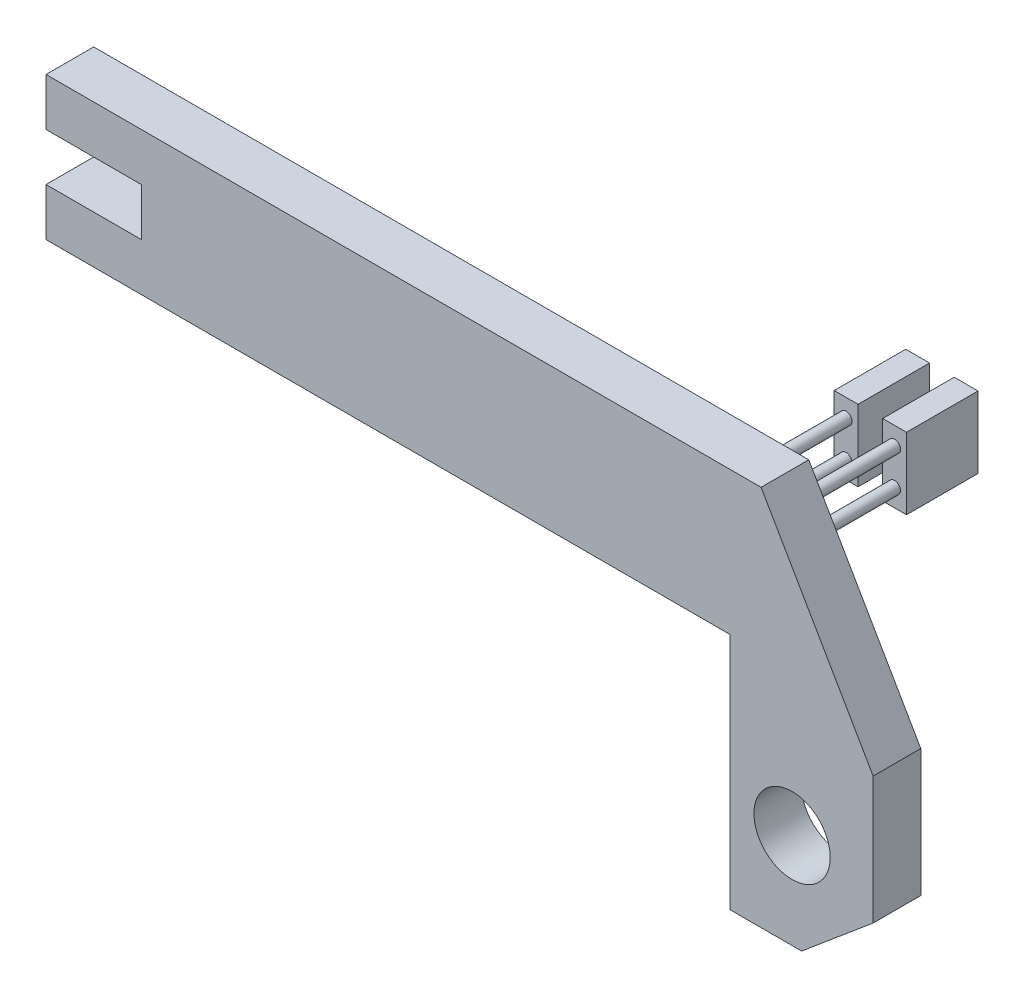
from build123d import *

# Parameters (mm, degrees)
ESQUISSE1_R        = 1.6
BOSS_EXTRU_1_DEPTH = 2
ESQUISSE2_R        = 0.25
BOSS_EXTRU_2_DEPTH = 5.5
ESQUISSE3_W        = 1
ESQUISSE3_H        = 3
BOSS_EXTRU_3_DEPTH = 3


with BuildPart() as part:
    # Esquisse1 → Boss.-Extru.1 (new body)
    with BuildSketch(Plane.XY):
        Polygon((0, 0), (28.7, 0), (28.7, -10), (31.7, -10), (34.7, -7.482701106), (34.7, -2.140638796), (30, 6), (0, 6), (0, 4), (4, 4), (4, 2), (0, 2), align=None)
        with Locations((31.3, -6)):
            Circle(ESQUISSE1_R, mode=Mode.SUBTRACT)
    extrude(amount=BOSS_EXTRU_1_DEPTH)

    # Esquisse2 → Boss.-Extru.2 (add)
    with BuildSketch(Plane(origin=(0, 0, 0), x_dir=(-1, 0, 0), z_dir=(0, 0, -1))):
        with Locations(Location((-28.1, 1.3, 0), (0, 0, 180))):
            Circle(ESQUISSE2_R)
        with Locations(Location((-28.1, 2.8, 0), (0, 0, 180))):
            Circle(ESQUISSE2_R)
        with Locations(Location((-26.067622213, 1.3, 0), (0, 0, 180))):
            Circle(ESQUISSE2_R)
        with Locations(Location((-26.067622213, 2.8, 0), (0, 0, 180))):
            Circle(ESQUISSE2_R)
    extrude(amount=BOSS_EXTRU_2_DEPTH)

    # Esquisse3 → Boss.-Extru.3 (add)
    with BuildSketch(Plane(origin=(0, 0, -5.5), x_dir=(-1, 0, 0), z_dir=(0, 0, -1))):
        with Locations((-28.1, 2.05)):
            Rectangle(ESQUISSE3_W, ESQUISSE3_H)
        with Locations((-26.067622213, 2.05)):
            Rectangle(ESQUISSE3_W, ESQUISSE3_H)
    extrude(amount=BOSS_EXTRU_3_DEPTH)


solid = part.part
